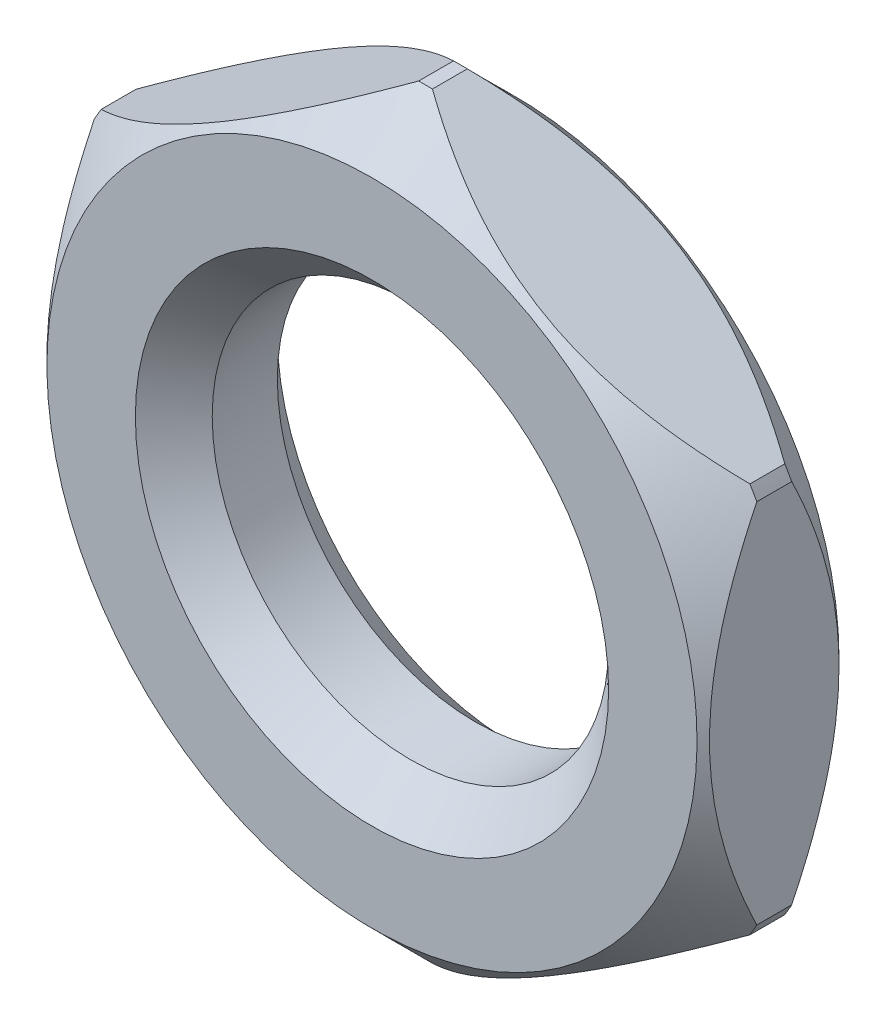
ISO-10303-21;
HEADER;
FILE_DESCRIPTION(('STEP AP214'),'2;1');
FILE_NAME('part.step','',(''),(''),'','','');
FILE_SCHEMA(('AUTOMOTIVE_DESIGN { 1 0 10303 214 1 1 1 1 }'));
ENDSEC;
DATA;
#1=APPLICATION_CONTEXT('core data for automotive mechanical design processes');
#2=APPLICATION_PROTOCOL_DEFINITION('international standard','automotive_design',2000,#1);
#3=PRODUCT_CONTEXT('',#1,'mechanical');
#4=PRODUCT('Part','Part','',(#3));
#5=PRODUCT_RELATED_PRODUCT_CATEGORY('part','',(#4));
#6=PRODUCT_DEFINITION_FORMATION('','',#4);
#7=PRODUCT_DEFINITION_CONTEXT('part definition',#1,'design');
#8=PRODUCT_DEFINITION('design','',#6,#7);
#9=PRODUCT_DEFINITION_SHAPE('','',#8);
#10=(LENGTH_UNIT() NAMED_UNIT(*) SI_UNIT(.MILLI.,.METRE.));
#11=(NAMED_UNIT(*) PLANE_ANGLE_UNIT() SI_UNIT($,.RADIAN.));
#12=(NAMED_UNIT(*) SI_UNIT($,.STERADIAN.) SOLID_ANGLE_UNIT());
#13=UNCERTAINTY_MEASURE_WITH_UNIT(LENGTH_MEASURE(1.E-05),#10,'distance_accuracy_value','');
#14=(GEOMETRIC_REPRESENTATION_CONTEXT(3) GLOBAL_UNCERTAINTY_ASSIGNED_CONTEXT((#13)) GLOBAL_UNIT_ASSIGNED_CONTEXT((#10,
#11,#12)) REPRESENTATION_CONTEXT('',''));
#15=CARTESIAN_POINT('',(0.,0.,0.));
#16=DIRECTION('',(0.,0.,1.));
#17=DIRECTION('',(1.,0.,0.));
#18=AXIS2_PLACEMENT_3D('',#15,#16,#17);
#19=CARTESIAN_POINT('',(0.,5.,0.));
#20=DIRECTION('',(0.,0.,-1.));
#21=DIRECTION('',(-1.,0.,0.));
#22=AXIS2_PLACEMENT_3D('',#19,#20,#21);
#23=PLANE('',#22);
#24=CARTESIAN_POINT('',(0.,0.,0.));
#25=DIRECTION('',(0.,0.,-1.));
#26=DIRECTION('',(-1.,0.,0.));
#27=AXIS2_PLACEMENT_3D('',#24,#25,#26);
#28=CIRCLE('',#27,4.99999999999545);
#29=CARTESIAN_POINT('',(-4.99999999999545,0.,0.));
#30=VERTEX_POINT('',#29);
#31=EDGE_CURVE('E19',#30,#30,#28,.F.);
#32=ORIENTED_EDGE('',*,*,#31,.T.);
#33=EDGE_LOOP('',(#32));
#34=FACE_BOUND('',#33,.T.);
#35=CARTESIAN_POINT('',(0.,0.,0.));
#36=DIRECTION('',(0.,0.,1.));
#37=DIRECTION('',(1.,0.,0.));
#38=AXIS2_PLACEMENT_3D('',#35,#36,#37);
#39=CIRCLE('',#38,6.86862915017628);
#40=CARTESIAN_POINT('',(6.86862915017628,0.,0.));
#41=VERTEX_POINT('',#40);
#42=EDGE_CURVE('E135',#41,#41,#39,.T.);
#43=ORIENTED_EDGE('',*,*,#42,.F.);
#44=EDGE_LOOP('',(#43));
#45=FACE_BOUND('',#44,.T.);
#46=ADVANCED_FACE('F16',(#34,#45),#23,.T.);
#47=CARTESIAN_POINT('',(0.,0.,0.));
#48=DIRECTION('',(0.,0.,-1.));
#49=DIRECTION('',(-1.,0.,0.));
#50=AXIS2_PLACEMENT_3D('',#47,#48,#49);
#51=CONICAL_SURFACE('',#50,4.99999999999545,0.785398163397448);
#52=CARTESIAN_POINT('',(0.,0.,0.812));
#53=DIRECTION('',(0.,0.,1.));
#54=DIRECTION('',(1.,0.,0.));
#55=AXIS2_PLACEMENT_3D('',#52,#53,#54);
#56=CIRCLE('',#55,4.188);
#57=CARTESIAN_POINT('',(4.188,0.,0.812));
#58=VERTEX_POINT('',#57);
#59=EDGE_CURVE('E112',#58,#58,#56,.T.);
#60=ORIENTED_EDGE('',*,*,#59,.T.);
#61=EDGE_LOOP('',(#60));
#62=FACE_BOUND('',#61,.T.);
#63=ORIENTED_EDGE('',*,*,#31,.F.);
#64=EDGE_LOOP('',(#63));
#65=FACE_BOUND('',#64,.T.);
#66=ADVANCED_FACE('F250',(#62,#65),#51,.F.);
#67=CARTESIAN_POINT('',(0.,0.,1.13137084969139));
#68=DIRECTION('',(0.,0.,1.));
#69=DIRECTION('',(1.,0.,0.));
#70=AXIS2_PLACEMENT_3D('',#67,#68,#69);
#71=CONICAL_SURFACE('',#70,7.99999999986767,0.785398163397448);
#72=ORIENTED_EDGE('',*,*,#42,.T.);
#73=EDGE_LOOP('',(#72));
#74=FACE_BOUND('',#73,.T.);
#75=CARTESIAN_POINT('',(-6.99999999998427,-3.87298334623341,1.13137084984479));
#76=CARTESIAN_POINT('',(-6.9999999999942,-3.73890234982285,1.06646789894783));
#77=CARTESIAN_POINT('',(-6.99999999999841,-3.60381503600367,1.00364050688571));
#78=CARTESIAN_POINT('',(-7.00000000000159,-3.33145367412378,0.882735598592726));
#79=CARTESIAN_POINT('',(-7.00000000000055,-3.19417855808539,0.824660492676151));
#80=CARTESIAN_POINT('',(-6.99999999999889,-2.77770104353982,0.65803272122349));
#81=CARTESIAN_POINT('',(-6.99999999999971,-2.49511749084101,0.557706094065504));
#82=CARTESIAN_POINT('',(-7.00000000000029,-1.92540167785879,0.386349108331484));
#83=CARTESIAN_POINT('',(-7.00000000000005,-1.63839364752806,0.314917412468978));
#84=CARTESIAN_POINT('',(-6.99999999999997,-1.20352314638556,0.232651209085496));
#85=CARTESIAN_POINT('',(-6.99999999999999,-1.05796660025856,0.209385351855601));
#86=CARTESIAN_POINT('',(-7.00000000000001,-0.76572878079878,0.171637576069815));
#87=CARTESIAN_POINT('',(-7.,-0.61904764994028,0.157154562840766));
#88=CARTESIAN_POINT('',(-7.,-0.253257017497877,0.132555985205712));
#89=CARTESIAN_POINT('',(-7.,-0.0337446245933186,0.128023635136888));
#90=CARTESIAN_POINT('',(-7.,0.404777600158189,0.139633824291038));
#91=CARTESIAN_POINT('',(-7.,0.62378723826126,0.155783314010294));
#92=CARTESIAN_POINT('',(-7.,1.05962444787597,0.207804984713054));
#93=CARTESIAN_POINT('',(-7.,1.27644975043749,0.2436958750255));
#94=CARTESIAN_POINT('',(-7.,1.70632611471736,0.333267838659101));
#95=CARTESIAN_POINT('',(-7.,1.91937750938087,0.386947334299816));
#96=CARTESIAN_POINT('',(-7.,2.28037530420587,0.492038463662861));
#97=CARTESIAN_POINT('',(-7.,2.42944494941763,0.539672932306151));
#98=CARTESIAN_POINT('',(-7.,2.72518033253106,0.641854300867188));
#99=CARTESIAN_POINT('',(-7.,2.87184624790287,0.696400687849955));
#100=CARTESIAN_POINT('',(-7.,3.16229217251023,0.811367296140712));
#101=CARTESIAN_POINT('',(-7.,3.30607997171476,0.871767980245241));
#102=CARTESIAN_POINT('',(-7.,3.59128027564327,0.997817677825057));
#103=CARTESIAN_POINT('',(-7.,3.73269360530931,1.06346482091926));
#104=CARTESIAN_POINT('',(-7.,3.87298334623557,1.13137084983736));
#105=B_SPLINE_CURVE_WITH_KNOTS('',3,(#75,#76,#77,#78,#79,#80,#81,#82,#83,#84,#85,#86,#87,#88,
#89,#90,#91,#92,#93,#94,#95,#96,#97,#98,#99,#100,#101,#102,#103,#104),.UNSPECIFIED.,.F.,.F.,(4,
2,2,2,2,2,2,2,2,2,2,2,2,2,4),(0.,0.446863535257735,0.893952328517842,1.79237297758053,
2.67784702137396,3.11982657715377,3.56175103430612,4.21940284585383,4.87727573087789,
5.53577317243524,6.19421222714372,6.66352905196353,7.13281106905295,7.60057763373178,
8.06817817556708),.UNSPECIFIED.);
#106=CARTESIAN_POINT('',(-7.,-3.87298334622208,1.1313708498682));
#107=VERTEX_POINT('',#106);
#108=CARTESIAN_POINT('',(-7.,3.87298334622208,1.1313708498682));
#109=VERTEX_POINT('',#108);
#110=EDGE_CURVE('E118',#107,#109,#105,.T.);
#111=ORIENTED_EDGE('',*,*,#110,.T.);
#112=CARTESIAN_POINT('',(0.,0.,1.13137084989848));
#113=DIRECTION('',(0.,0.,1.));
#114=DIRECTION('',(1.,0.,0.));
#115=AXIS2_PLACEMENT_3D('',#112,#113,#114);
#116=CIRCLE('',#115,8.);
#117=CARTESIAN_POINT('',(-6.85410196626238,4.12568615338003,1.1313708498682));
#118=VERTEX_POINT('',#117);
#119=EDGE_CURVE('E115',#118,#109,#116,.T.);
#120=ORIENTED_EDGE('',*,*,#119,.F.);
#121=CARTESIAN_POINT('',(-6.85410196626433,4.12568615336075,1.13137084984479));
#122=CARTESIAN_POINT('',(-6.73798441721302,4.19272665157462,1.06646789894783));
#123=CARTESIAN_POINT('',(-6.62099537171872,4.26027030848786,1.00364050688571));
#124=CARTESIAN_POINT('',(-6.385123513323,4.39645098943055,0.882735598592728));
#125=CARTESIAN_POINT('',(-6.26623977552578,4.46508854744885,0.824660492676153));
#126=CARTESIAN_POINT('',(-5.90555966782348,4.67332730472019,0.658032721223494));
#127=CARTESIAN_POINT('',(-5.66083513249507,4.8146190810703,0.557706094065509));
#128=CARTESIAN_POINT('',(-5.16744676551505,5.09947698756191,0.386349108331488));
#129=CARTESIAN_POINT('',(-4.91889052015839,5.24298100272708,0.31491741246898));
#130=CARTESIAN_POINT('',(-4.54228161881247,5.46041625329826,0.232651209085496));
#131=CARTESIAN_POINT('',(-4.41622595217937,5.53319452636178,0.2093853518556));
#132=CARTESIAN_POINT('',(-4.16314057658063,5.67931343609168,0.171637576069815));
#133=CARTESIAN_POINT('',(-4.03611099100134,5.75265400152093,0.157154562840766));
#134=CARTESIAN_POINT('',(-3.71932701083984,5.93554931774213,0.132555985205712));
#135=CARTESIAN_POINT('',(-3.52922370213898,6.04530551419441,0.128023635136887));
#136=CARTESIAN_POINT('',(-3.1494523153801,6.26456662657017,0.139633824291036));
#137=CARTESIAN_POINT('',(-2.9597844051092,6.3740714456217,0.155783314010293));
#138=CARTESIAN_POINT('',(-2.58233830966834,6.59199005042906,0.207804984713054));
#139=CARTESIAN_POINT('',(-2.39456208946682,6.70040270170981,0.2436958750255));
#140=CARTESIAN_POINT('',(-2.02227823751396,6.91534088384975,0.333267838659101));
#141=CARTESIAN_POINT('',(-1.83777031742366,7.02186658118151,0.386947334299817));
#142=CARTESIAN_POINT('',(-1.52513705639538,7.20236547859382,0.492038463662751));
#143=CARTESIAN_POINT('',(-1.39603895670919,7.27690030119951,0.53967293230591));
#144=CARTESIAN_POINT('',(-1.13992460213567,7.42476799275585,0.641854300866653));
#145=CARTESIAN_POINT('',(-1.0129081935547,7.49810095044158,0.696400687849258));
#146=CARTESIAN_POINT('',(-0.761374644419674,7.6433239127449,0.811367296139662));
#147=CARTESIAN_POINT('',(-0.636850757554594,7.715217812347,0.871767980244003));
#148=CARTESIAN_POINT('',(-0.389860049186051,7.85781796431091,0.997817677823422));
#149=CARTESIAN_POINT('',(-0.26739251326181,7.92852462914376,1.06346482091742));
#150=CARTESIAN_POINT('',(-0.145898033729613,7.99866949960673,1.1313708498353));
#151=B_SPLINE_CURVE_WITH_KNOTS('',3,(#121,#122,#123,#124,#125,#126,#127,#128,#129,#130,#131,
#132,#133,#134,#135,#136,#137,#138,#139,#140,#141,#142,#143,#144,#145,#146,#147,#148,#149,#150),
.UNSPECIFIED.,.F.,.F.,(4,2,2,2,2,2,2,2,2,2,2,2,2,2,4),(0.,0.446863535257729,0.893952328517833,
1.79237297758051,2.67784702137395,3.11982657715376,3.56175103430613,4.21940284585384,
4.8772757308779,5.53577317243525,6.19421222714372,6.66352905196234,7.13281106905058,
7.60057763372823,8.06817817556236),.UNSPECIFIED.);
#152=CARTESIAN_POINT('',(-0.145898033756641,7.99866949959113,1.13137084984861));
#153=VERTEX_POINT('',#152);
#154=EDGE_CURVE('E103',#118,#153,#151,.T.);
#155=ORIENTED_EDGE('',*,*,#154,.T.);
#156=CARTESIAN_POINT('',(0.,0.,1.13137084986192));
#157=DIRECTION('',(0.,0.,1.));
#158=DIRECTION('',(1.,0.,0.));
#159=AXIS2_PLACEMENT_3D('',#156,#157,#158);
#160=CIRCLE('',#159,7.99999999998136);
#161=CARTESIAN_POINT('',(0.145898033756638,7.99866949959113,1.13137084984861));
#162=VERTEX_POINT('',#161);
#163=EDGE_CURVE('E138',#153,#162,#160,.F.);
#164=ORIENTED_EDGE('',*,*,#163,.T.);
#165=CARTESIAN_POINT('',(0.145898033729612,7.99866949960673,1.1313708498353));
#166=CARTESIAN_POINT('',(0.262015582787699,7.9316290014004,1.06646789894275));
#167=CARTESIAN_POINT('',(0.379004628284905,7.86408534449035,1.00364050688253));
#168=CARTESIAN_POINT('',(0.61487648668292,7.72790466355,0.882735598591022));
#169=CARTESIAN_POINT('',(0.733760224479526,7.65926710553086,0.824660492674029));
#170=CARTESIAN_POINT('',(1.09444033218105,7.45102834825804,0.658032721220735));
#171=CARTESIAN_POINT('',(1.3391648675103,7.3097365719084,0.557706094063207));
#172=CARTESIAN_POINT('',(1.83255323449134,7.02487866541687,0.386349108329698));
#173=CARTESIAN_POINT('',(2.0811094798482,6.88137465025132,0.314917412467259));
#174=CARTESIAN_POINT('',(2.45771838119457,6.66393939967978,0.232651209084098));
#175=CARTESIAN_POINT('',(2.58377404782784,6.59116112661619,0.209385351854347));
#176=CARTESIAN_POINT('',(2.83685942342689,6.44504221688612,0.171637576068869));
#177=CARTESIAN_POINT('',(2.96388900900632,6.37170165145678,0.157154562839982));
#178=CARTESIAN_POINT('',(3.28067298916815,6.18880633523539,0.132555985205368));
#179=CARTESIAN_POINT('',(3.47077629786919,6.07905013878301,0.128023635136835));
#180=CARTESIAN_POINT('',(3.85054768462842,5.85978902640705,0.139633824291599));
#181=CARTESIAN_POINT('',(4.04021559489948,5.75028420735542,0.155783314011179));
#182=CARTESIAN_POINT('',(4.41766169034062,5.5323656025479,0.207804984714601));
#183=CARTESIAN_POINT('',(4.60543791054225,5.42395295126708,0.24369587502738));
#184=CARTESIAN_POINT('',(4.97772176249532,5.20901476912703,0.333267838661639));
#185=CARTESIAN_POINT('',(5.16222968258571,5.10248907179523,0.386947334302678));
#186=CARTESIAN_POINT('',(5.47486294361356,4.92199017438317,0.492038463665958));
#187=CARTESIAN_POINT('',(5.60396104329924,4.84745535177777,0.53967293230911));
#188=CARTESIAN_POINT('',(5.86007539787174,4.699587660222,0.641854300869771));
#189=CARTESIAN_POINT('',(5.98709180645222,4.62625470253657,0.6964006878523));
#190=CARTESIAN_POINT('',(6.23862535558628,4.4810317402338,0.811367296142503));
#191=CARTESIAN_POINT('',(6.36314924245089,4.40913784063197,0.871767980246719));
#192=CARTESIAN_POINT('',(6.61013995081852,4.26653768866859,0.997817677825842));
#193=CARTESIAN_POINT('',(6.73260748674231,4.195831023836,1.06346482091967));
#194=CARTESIAN_POINT('',(6.85410196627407,4.12568615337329,1.13137084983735));
#195=B_SPLINE_CURVE_WITH_KNOTS('',3,(#165,#166,#167,#168,#169,#170,#171,#172,#173,#174,#175,
#176,#177,#178,#179,#180,#181,#182,#183,#184,#185,#186,#187,#188,#189,#190,#191,#192,#193,#194),
.UNSPECIFIED.,.F.,.F.,(4,2,2,2,2,2,2,2,2,2,2,2,2,2,4),(0.,0.446863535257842,0.89395232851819,
1.79237297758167,2.67784702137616,3.11982657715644,3.56175103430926,4.21940284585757,
4.87727573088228,5.53577317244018,6.19421222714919,6.66352905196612,7.13281106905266,
7.60057763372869,8.06817817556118),.UNSPECIFIED.);
#196=CARTESIAN_POINT('',(6.85410196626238,4.12568615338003,1.1313708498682));
#197=VERTEX_POINT('',#196);
#198=EDGE_CURVE('E132',#162,#197,#195,.T.);
#199=ORIENTED_EDGE('',*,*,#198,.T.);
#200=CARTESIAN_POINT('',(0.,0.,1.13137084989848));
#201=DIRECTION('',(0.,0.,1.));
#202=DIRECTION('',(1.,0.,0.));
#203=AXIS2_PLACEMENT_3D('',#200,#201,#202);
#204=CIRCLE('',#203,8.);
#205=CARTESIAN_POINT('',(7.,3.87298334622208,1.1313708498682));
#206=VERTEX_POINT('',#205);
#207=EDGE_CURVE('E140',#206,#197,#204,.T.);
#208=ORIENTED_EDGE('',*,*,#207,.F.);
#209=CARTESIAN_POINT('',(6.99999999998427,3.87298334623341,1.13137084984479));
#210=CARTESIAN_POINT('',(6.9999999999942,3.73890234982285,1.06646789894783));
#211=CARTESIAN_POINT('',(6.99999999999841,3.60381503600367,1.00364050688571));
#212=CARTESIAN_POINT('',(7.00000000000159,3.33145367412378,0.882735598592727));
#213=CARTESIAN_POINT('',(7.00000000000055,3.19417855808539,0.824660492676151));
#214=CARTESIAN_POINT('',(6.99999999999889,2.77770104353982,0.65803272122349));
#215=CARTESIAN_POINT('',(6.99999999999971,2.49511749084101,0.557706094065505));
#216=CARTESIAN_POINT('',(7.00000000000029,1.92540167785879,0.386349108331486));
#217=CARTESIAN_POINT('',(7.00000000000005,1.63839364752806,0.31491741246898));
#218=CARTESIAN_POINT('',(6.99999999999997,1.20352314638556,0.232651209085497));
#219=CARTESIAN_POINT('',(6.99999999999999,1.05796660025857,0.209385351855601));
#220=CARTESIAN_POINT('',(7.00000000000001,0.765728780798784,0.171637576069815));
#221=CARTESIAN_POINT('',(7.,0.619047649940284,0.157154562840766));
#222=CARTESIAN_POINT('',(7.,0.253257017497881,0.132555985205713));
#223=CARTESIAN_POINT('',(7.,0.0337446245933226,0.128023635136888));
#224=CARTESIAN_POINT('',(7.,-0.404777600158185,0.139633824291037));
#225=CARTESIAN_POINT('',(7.,-0.623787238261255,0.155783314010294));
#226=CARTESIAN_POINT('',(7.,-1.05962444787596,0.207804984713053));
#227=CARTESIAN_POINT('',(7.,-1.27644975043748,0.243695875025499));
#228=CARTESIAN_POINT('',(7.,-1.70632611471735,0.3332678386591));
#229=CARTESIAN_POINT('',(7.,-1.91937750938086,0.386947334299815));
#230=CARTESIAN_POINT('',(7.,-2.28037530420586,0.49203846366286));
#231=CARTESIAN_POINT('',(7.,-2.42944494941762,0.539672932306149));
#232=CARTESIAN_POINT('',(7.,-2.72518033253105,0.641854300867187));
#233=CARTESIAN_POINT('',(7.,-2.87184624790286,0.696400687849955));
#234=CARTESIAN_POINT('',(7.,-3.16229217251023,0.811367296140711));
#235=CARTESIAN_POINT('',(7.,-3.30607997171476,0.87176798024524));
#236=CARTESIAN_POINT('',(7.,-3.59128027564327,0.997817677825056));
#237=CARTESIAN_POINT('',(7.,-3.73269360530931,1.06346482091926));
#238=CARTESIAN_POINT('',(7.,-3.87298334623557,1.13137084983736));
#239=B_SPLINE_CURVE_WITH_KNOTS('',3,(#209,#210,#211,#212,#213,#214,#215,#216,#217,#218,#219,
#220,#221,#222,#223,#224,#225,#226,#227,#228,#229,#230,#231,#232,#233,#234,#235,#236,#237,#238),
.UNSPECIFIED.,.F.,.F.,(4,2,2,2,2,2,2,2,2,2,2,2,2,2,4),(0.,0.446863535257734,0.893952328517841,
1.79237297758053,2.67784702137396,3.11982657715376,3.56175103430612,4.21940284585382,
4.87727573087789,5.53577317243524,6.19421222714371,6.66352905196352,7.13281106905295,
7.60057763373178,8.06817817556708),.UNSPECIFIED.);
#240=CARTESIAN_POINT('',(7.,-3.87298334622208,1.1313708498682));
#241=VERTEX_POINT('',#240);
#242=EDGE_CURVE('E267',#206,#241,#239,.T.);
#243=ORIENTED_EDGE('',*,*,#242,.T.);
#244=CARTESIAN_POINT('',(0.,0.,1.13137084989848));
#245=DIRECTION('',(0.,0.,1.));
#246=DIRECTION('',(1.,0.,0.));
#247=AXIS2_PLACEMENT_3D('',#244,#245,#246);
#248=CIRCLE('',#247,8.);
#249=CARTESIAN_POINT('',(6.85410196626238,-4.12568615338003,1.1313708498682));
#250=VERTEX_POINT('',#249);
#251=EDGE_CURVE('E144',#250,#241,#248,.T.);
#252=ORIENTED_EDGE('',*,*,#251,.F.);
#253=CARTESIAN_POINT('',(6.85410196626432,-4.12568615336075,1.13137084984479));
#254=CARTESIAN_POINT('',(6.73798441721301,-4.19272665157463,1.06646789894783));
#255=CARTESIAN_POINT('',(6.62099537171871,-4.26027030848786,1.00364050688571));
#256=CARTESIAN_POINT('',(6.38512351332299,-4.39645098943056,0.882735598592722));
#257=CARTESIAN_POINT('',(6.26623977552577,-4.46508854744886,0.824660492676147));
#258=CARTESIAN_POINT('',(5.90555966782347,-4.6733273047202,0.658032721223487));
#259=CARTESIAN_POINT('',(5.66083513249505,-4.81461908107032,0.557706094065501));
#260=CARTESIAN_POINT('',(5.16744676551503,-5.09947698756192,0.386349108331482));
#261=CARTESIAN_POINT('',(4.91889052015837,-5.24298100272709,0.314917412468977));
#262=CARTESIAN_POINT('',(4.54228161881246,-5.46041625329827,0.232651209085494));
#263=CARTESIAN_POINT('',(4.41622595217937,-5.53319452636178,0.209385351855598));
#264=CARTESIAN_POINT('',(4.16314057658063,-5.67931343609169,0.171637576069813));
#265=CARTESIAN_POINT('',(4.03611099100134,-5.75265400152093,0.157154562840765));
#266=CARTESIAN_POINT('',(3.71932701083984,-5.93554931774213,0.132555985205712));
#267=CARTESIAN_POINT('',(3.52922370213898,-6.04530551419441,0.128023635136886));
#268=CARTESIAN_POINT('',(3.14945231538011,-6.26456662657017,0.139633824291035));
#269=CARTESIAN_POINT('',(2.95978440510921,-6.3740714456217,0.155783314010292));
#270=CARTESIAN_POINT('',(2.58233830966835,-6.59199005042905,0.207804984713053));
#271=CARTESIAN_POINT('',(2.39456208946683,-6.70040270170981,0.243695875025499));
#272=CARTESIAN_POINT('',(2.02227823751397,-6.91534088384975,0.333267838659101));
#273=CARTESIAN_POINT('',(1.83777031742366,-7.02186658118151,0.386947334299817));
#274=CARTESIAN_POINT('',(1.52513705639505,-7.20236547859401,0.492038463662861));
#275=CARTESIAN_POINT('',(1.39603895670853,-7.27690030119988,0.53967293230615));
#276=CARTESIAN_POINT('',(1.13992460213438,-7.4247679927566,0.641854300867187));
#277=CARTESIAN_POINT('',(1.01290819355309,-7.4981009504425,0.696400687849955));
#278=CARTESIAN_POINT('',(0.761374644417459,-7.64332391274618,0.81136729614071));
#279=CARTESIAN_POINT('',(0.636850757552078,-7.71521781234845,0.871767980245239));
#280=CARTESIAN_POINT('',(0.389860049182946,-7.8578179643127,0.997817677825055));
#281=CARTESIAN_POINT('',(0.267392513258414,-7.92852462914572,1.06346482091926));
#282=CARTESIAN_POINT('',(0.145898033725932,-7.99866949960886,1.13137084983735));
#283=B_SPLINE_CURVE_WITH_KNOTS('',3,(#253,#254,#255,#256,#257,#258,#259,#260,#261,#262,#263,
#264,#265,#266,#267,#268,#269,#270,#271,#272,#273,#274,#275,#276,#277,#278,#279,#280,#281,#282),
.UNSPECIFIED.,.F.,.F.,(4,2,2,2,2,2,2,2,2,2,2,2,2,2,4),(0.,0.446863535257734,0.89395232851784,
1.79237297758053,2.67784702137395,3.11982657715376,3.56175103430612,4.21940284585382,
4.87727573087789,5.53577317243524,6.19421222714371,6.66352905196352,7.13281106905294,
7.60057763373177,8.06817817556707),.UNSPECIFIED.);
#284=CARTESIAN_POINT('',(0.14589803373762,-7.99866949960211,1.1313708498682));
#285=VERTEX_POINT('',#284);
#286=EDGE_CURVE('E236',#250,#285,#283,.T.);
#287=ORIENTED_EDGE('',*,*,#286,.T.);
#288=CARTESIAN_POINT('',(0.,0.,1.13137084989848));
#289=DIRECTION('',(0.,0.,1.));
#290=DIRECTION('',(1.,0.,0.));
#291=AXIS2_PLACEMENT_3D('',#288,#289,#290);
#292=CIRCLE('',#291,8.);
#293=CARTESIAN_POINT('',(-0.145898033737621,-7.99866949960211,1.1313708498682));
#294=VERTEX_POINT('',#293);
#295=EDGE_CURVE('E148',#294,#285,#292,.T.);
#296=ORIENTED_EDGE('',*,*,#295,.F.);
#297=CARTESIAN_POINT('',(-0.145898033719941,-7.99866949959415,1.13137084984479));
#298=CARTESIAN_POINT('',(-0.262015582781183,-7.93162900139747,1.06646789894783));
#299=CARTESIAN_POINT('',(-0.379004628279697,-7.86408534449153,1.00364050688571));
#300=CARTESIAN_POINT('',(-0.614876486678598,-7.72790466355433,0.882735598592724));
#301=CARTESIAN_POINT('',(-0.733760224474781,-7.65926710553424,0.824660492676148));
#302=CARTESIAN_POINT('',(-1.09444033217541,-7.45102834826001,0.658032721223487));
#303=CARTESIAN_POINT('',(-1.33916486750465,-7.30973657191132,0.557706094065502));
#304=CARTESIAN_POINT('',(-1.83255323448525,-7.02487866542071,0.386349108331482));
#305=CARTESIAN_POINT('',(-2.08110947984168,-6.88137465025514,0.314917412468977));
#306=CARTESIAN_POINT('',(-2.45771838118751,-6.66393939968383,0.232651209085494));
#307=CARTESIAN_POINT('',(-2.58377404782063,-6.59116112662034,0.209385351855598));
#308=CARTESIAN_POINT('',(-2.83685942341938,-6.44504221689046,0.171637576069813));
#309=CARTESIAN_POINT('',(-2.96388900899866,-6.37170165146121,0.157154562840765));
#310=CARTESIAN_POINT('',(-3.28067298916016,-6.18880633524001,0.132555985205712));
#311=CARTESIAN_POINT('',(-3.47077629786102,-6.07905013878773,0.128023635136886));
#312=CARTESIAN_POINT('',(-3.85054768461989,-5.85978902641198,0.139633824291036));
#313=CARTESIAN_POINT('',(-4.04021559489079,-5.75028420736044,0.155783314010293));
#314=CARTESIAN_POINT('',(-4.41766169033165,-5.53236560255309,0.207804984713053));
#315=CARTESIAN_POINT('',(-4.60543791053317,-5.42395295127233,0.243695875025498));
#316=CARTESIAN_POINT('',(-4.97772176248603,-5.20901476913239,0.3332678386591));
#317=CARTESIAN_POINT('',(-5.16222968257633,-5.10248907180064,0.386947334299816));
#318=CARTESIAN_POINT('',(-5.47486294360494,-4.92199017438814,0.49203846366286));
#319=CARTESIAN_POINT('',(-5.60396104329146,-4.84745535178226,0.539672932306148));
#320=CARTESIAN_POINT('',(-5.86007539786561,-4.69958766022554,0.641854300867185));
#321=CARTESIAN_POINT('',(-5.9870918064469,-4.62625470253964,0.696400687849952));
#322=CARTESIAN_POINT('',(-6.23862535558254,-4.48103174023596,0.811367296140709));
#323=CARTESIAN_POINT('',(-6.36314924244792,-4.40913784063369,0.871767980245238));
#324=CARTESIAN_POINT('',(-6.61013995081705,-4.26653768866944,0.997817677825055));
#325=CARTESIAN_POINT('',(-6.73260748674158,-4.19583102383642,1.06346482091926));
#326=CARTESIAN_POINT('',(-6.85410196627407,-4.12568615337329,1.13137084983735));
#327=B_SPLINE_CURVE_WITH_KNOTS('',3,(#297,#298,#299,#300,#301,#302,#303,#304,#305,#306,#307,
#308,#309,#310,#311,#312,#313,#314,#315,#316,#317,#318,#319,#320,#321,#322,#323,#324,#325,#326),
.UNSPECIFIED.,.F.,.F.,(4,2,2,2,2,2,2,2,2,2,2,2,2,2,4),(0.,0.446863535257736,0.893952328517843,
1.79237297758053,2.67784702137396,3.11982657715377,3.56175103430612,4.21940284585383,
4.87727573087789,5.53577317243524,6.19421222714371,6.66352905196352,7.13281106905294,
7.60057763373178,8.06817817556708),.UNSPECIFIED.);
#328=CARTESIAN_POINT('',(-6.85410196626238,-4.12568615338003,1.1313708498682));
#329=VERTEX_POINT('',#328);
#330=EDGE_CURVE('E227',#294,#329,#327,.T.);
#331=ORIENTED_EDGE('',*,*,#330,.T.);
#332=CARTESIAN_POINT('',(0.,0.,1.13137084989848));
#333=DIRECTION('',(0.,0.,1.));
#334=DIRECTION('',(1.,0.,0.));
#335=AXIS2_PLACEMENT_3D('',#332,#333,#334);
#336=CIRCLE('',#335,8.);
#337=EDGE_CURVE('E152',#107,#329,#336,.T.);
#338=ORIENTED_EDGE('',*,*,#337,.F.);
#339=EDGE_LOOP('',(#111,#120,#155,#164,#199,#208,#243,#252,#287,#296,#331,#338));
#340=FACE_BOUND('',#339,.T.);
#341=ADVANCED_FACE('F116',(#74,#340),#71,.T.);
#342=CARTESIAN_POINT('',(0.,0.,-50.));
#343=DIRECTION('',(0.,0.,1.));
#344=DIRECTION('',(1.,0.,0.));
#345=AXIS2_PLACEMENT_3D('',#342,#343,#344);
#346=CYLINDRICAL_SURFACE('',#345,4.188);
#347=CARTESIAN_POINT('',(0.,0.,2.1879999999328));
#348=DIRECTION('',(0.,0.,1.));
#349=DIRECTION('',(1.,0.,0.));
#350=AXIS2_PLACEMENT_3D('',#347,#348,#349);
#351=CIRCLE('',#350,4.1879999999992);
#352=CARTESIAN_POINT('',(4.1879999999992,0.,2.1879999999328));
#353=VERTEX_POINT('',#352);
#354=EDGE_CURVE('E308',#353,#353,#351,.T.);
#355=ORIENTED_EDGE('',*,*,#354,.T.);
#356=EDGE_LOOP('',(#355));
#357=FACE_BOUND('',#356,.T.);
#358=ORIENTED_EDGE('',*,*,#59,.F.);
#359=EDGE_LOOP('',(#358));
#360=FACE_BOUND('',#359,.T.);
#361=ADVANCED_FACE('F249',(#357,#360),#346,.F.);
#362=CARTESIAN_POINT('',(0.,8.08290376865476,15.));
#363=DIRECTION('',(0.5,-0.866025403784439,0.));
#364=DIRECTION('',(0.866025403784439,0.5,0.));
#365=AXIS2_PLACEMENT_3D('',#362,#363,#364);
#366=PLANE('',#365);
#367=DIRECTION('',(0.,0.,1.));
#368=VECTOR('',#367,1.);
#369=CARTESIAN_POINT('',(-6.85410196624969,4.12568615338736,-50.));
#370=LINE('',#369,#368);
#371=CARTESIAN_POINT('',(-6.85410196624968,4.12568615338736,1.86862915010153));
#372=VERTEX_POINT('',#371);
#373=EDGE_CURVE('E107',#372,#118,#370,.F.);
#374=ORIENTED_EDGE('',*,*,#373,.F.);
#375=CARTESIAN_POINT('',(-0.145898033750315,7.99866949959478,1.86862915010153));
#376=CARTESIAN_POINT('',(-0.262015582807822,7.93162900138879,1.93353210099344));
#377=CARTESIAN_POINT('',(-0.37900462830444,7.86408534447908,1.99635949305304));
#378=CARTESIAN_POINT('',(-0.614876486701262,7.72790466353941,2.11726440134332));
#379=CARTESIAN_POINT('',(-0.733760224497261,7.65926710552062,2.17533950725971));
#380=CARTESIAN_POINT('',(-1.09444033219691,7.45102834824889,2.34196727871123));
#381=CARTESIAN_POINT('',(-1.33916486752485,7.3097365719,2.44229390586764));
#382=CARTESIAN_POINT('',(-1.83255323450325,7.02487866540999,2.61365089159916));
#383=CARTESIAN_POINT('',(-2.08110947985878,6.88137465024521,2.68508258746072));
#384=CARTESIAN_POINT('',(-2.45771838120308,6.66393939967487,2.7673487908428));
#385=CARTESIAN_POINT('',(-2.58377404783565,6.59116112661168,2.79061464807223));
#386=CARTESIAN_POINT('',(-2.83685942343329,6.44504221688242,2.82836242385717));
#387=CARTESIAN_POINT('',(-2.96388900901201,6.37170165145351,2.84284543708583));
#388=CARTESIAN_POINT('',(-3.2806729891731,6.18880633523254,2.86744401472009));
#389=CARTESIAN_POINT('',(-3.4707762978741,6.07905013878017,2.87197636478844));
#390=CARTESIAN_POINT('',(-3.85054768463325,5.85978902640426,2.86036617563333));
#391=CARTESIAN_POINT('',(-4.04021559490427,5.75028420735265,2.84421668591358));
#392=CARTESIAN_POINT('',(-4.41766169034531,5.5323656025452,2.79219501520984));
#393=CARTESIAN_POINT('',(-4.60543791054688,5.42395295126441,2.75630412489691));
#394=CARTESIAN_POINT('',(-4.97772176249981,5.20901476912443,2.66673216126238));
#395=CARTESIAN_POINT('',(-5.16222968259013,5.10248907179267,2.61305266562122));
#396=CARTESIAN_POINT('',(-5.47486294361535,4.92199017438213,2.5079615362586));
#397=CARTESIAN_POINT('',(-5.60396104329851,4.84745535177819,2.46032706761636));
#398=CARTESIAN_POINT('',(-5.86007539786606,4.69958766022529,2.35814569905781));
#399=CARTESIAN_POINT('',(-5.9870918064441,4.62625470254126,2.30359931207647));
#400=CARTESIAN_POINT('',(-6.23862535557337,4.48103174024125,2.18863270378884));
#401=CARTESIAN_POINT('',(-6.36314924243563,4.40913784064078,2.12823201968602));
#402=CARTESIAN_POINT('',(-6.61013995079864,4.26653768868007,2.00218232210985));
#403=CARTESIAN_POINT('',(-6.73260748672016,4.19583102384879,1.93653517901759));
#404=CARTESIAN_POINT('',(-6.85410196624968,4.12568615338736,1.86862915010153));
#405=B_SPLINE_CURVE_WITH_KNOTS('',3,(#375,#376,#377,#378,#379,#380,#381,#382,#383,#384,#385,
#386,#387,#388,#389,#390,#391,#392,#393,#394,#395,#396,#397,#398,#399,#400,#401,#402,#403,#404),
.UNSPECIFIED.,.F.,.F.,(4,2,2,2,2,2,2,2,2,2,2,2,2,2,4),(0.,0.446863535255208,0.893952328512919,
1.79237297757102,2.67784702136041,3.11982657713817,3.56175103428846,4.21940284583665,
4.87727573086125,5.53577317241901,6.19421222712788,6.66352905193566,7.13281106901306,
7.60057763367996,8.06817817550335),.UNSPECIFIED.);
#406=CARTESIAN_POINT('',(-0.145898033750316,7.99866949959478,1.86862915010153));
#407=VERTEX_POINT('',#406);
#408=EDGE_CURVE('E310',#407,#372,#405,.T.);
#409=ORIENTED_EDGE('',*,*,#408,.F.);
#410=DIRECTION('',(0.,0.,1.));
#411=VECTOR('',#410,1.);
#412=CARTESIAN_POINT('',(-0.145898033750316,7.99866949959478,-50.));
#413=LINE('',#412,#411);
#414=EDGE_CURVE('E110',#153,#407,#413,.T.);
#415=ORIENTED_EDGE('',*,*,#414,.F.);
#416=ORIENTED_EDGE('',*,*,#154,.F.);
#417=EDGE_LOOP('',(#374,#409,#415,#416));
#418=FACE_BOUND('',#417,.T.);
#419=ADVANCED_FACE('F105',(#418),#366,.F.);
#420=CARTESIAN_POINT('',(0.,0.,-50.));
#421=DIRECTION('',(0.,0.,1.));
#422=DIRECTION('',(1.,0.,0.));
#423=AXIS2_PLACEMENT_3D('',#420,#421,#422);
#424=CYLINDRICAL_SURFACE('',#423,8.);
#425=DIRECTION('',(0.,0.,-1.));
#426=VECTOR('',#425,1.);
#427=CARTESIAN_POINT('',(-7.,3.87298334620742,15.));
#428=LINE('',#427,#426);
#429=CARTESIAN_POINT('',(-7.,3.87298334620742,1.86862915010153));
#430=VERTEX_POINT('',#429);
#431=EDGE_CURVE('E121',#109,#430,#428,.F.);
#432=ORIENTED_EDGE('',*,*,#431,.T.);
#433=CARTESIAN_POINT('',(0.,0.,1.86862915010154));
#434=DIRECTION('',(0.,0.,-1.));
#435=DIRECTION('',(-1.,0.,0.));
#436=AXIS2_PLACEMENT_3D('',#433,#434,#435);
#437=CIRCLE('',#436,8.);
#438=EDGE_CURVE('E125',#372,#430,#437,.F.);
#439=ORIENTED_EDGE('',*,*,#438,.F.);
#440=ORIENTED_EDGE('',*,*,#373,.T.);
#441=ORIENTED_EDGE('',*,*,#119,.T.);
#442=EDGE_LOOP('',(#432,#439,#440,#441));
#443=FACE_BOUND('',#442,.T.);
#444=ADVANCED_FACE('F123',(#443),#424,.T.);
#445=CARTESIAN_POINT('',(-7.,4.04145188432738,15.));
#446=DIRECTION('',(1.,0.,0.));
#447=DIRECTION('',(0.,0.,-1.));
#448=AXIS2_PLACEMENT_3D('',#445,#446,#447);
#449=PLANE('',#448);
#450=DIRECTION('',(0.,0.,1.));
#451=VECTOR('',#450,1.);
#452=CARTESIAN_POINT('',(-7.,-3.87298334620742,-50.));
#453=LINE('',#452,#451);
#454=CARTESIAN_POINT('',(-7.,-3.87298334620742,1.86862915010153));
#455=VERTEX_POINT('',#454);
#456=EDGE_CURVE('E154',#455,#107,#453,.F.);
#457=ORIENTED_EDGE('',*,*,#456,.F.);
#458=CARTESIAN_POINT('',(-7.,3.87298334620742,1.86862915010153));
#459=CARTESIAN_POINT('',(-7.,3.73890234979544,1.93353210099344));
#460=CARTESIAN_POINT('',(-7.,3.60381503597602,1.99635949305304));
#461=CARTESIAN_POINT('',(-7.,3.33145367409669,2.11726440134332));
#462=CARTESIAN_POINT('',(-7.,3.19417855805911,2.17533950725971));
#463=CARTESIAN_POINT('',(-7.,2.77770104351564,2.34196727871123));
#464=CARTESIAN_POINT('',(-7.,2.49511749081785,2.44229390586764));
#465=CARTESIAN_POINT('',(-7.,1.92540167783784,2.61365089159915));
#466=CARTESIAN_POINT('',(-7.,1.63839364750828,2.68508258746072));
#467=CARTESIAN_POINT('',(-7.,1.2035231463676,2.7673487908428));
#468=CARTESIAN_POINT('',(-7.,1.05796660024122,2.79061464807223));
#469=CARTESIAN_POINT('',(-7.,0.765728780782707,2.82836242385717));
#470=CARTESIAN_POINT('',(-7.,0.619047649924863,2.84284543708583));
#471=CARTESIAN_POINT('',(-7.,0.253257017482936,2.86744401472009));
#472=CARTESIAN_POINT('',(-7.,0.0337446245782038,2.87197636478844));
#473=CARTESIAN_POINT('',(-7.,-0.40477760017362,2.86036617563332));
#474=CARTESIAN_POINT('',(-7.,-0.623787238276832,2.84421668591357));
#475=CARTESIAN_POINT('',(-7.,-1.05962444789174,2.79219501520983));
#476=CARTESIAN_POINT('',(-7.,-1.27644975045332,2.7563041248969));
#477=CARTESIAN_POINT('',(-7.,-1.70632611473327,2.66673216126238));
#478=CARTESIAN_POINT('',(-7.,-1.9193775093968,2.61305266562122));
#479=CARTESIAN_POINT('',(-7.,-2.28037530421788,2.5079615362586));
#480=CARTESIAN_POINT('',(-7.,-2.42944494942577,2.46032706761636));
#481=CARTESIAN_POINT('',(-7.,-2.72518033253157,2.35814569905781));
#482=CARTESIAN_POINT('',(-7.,-2.87184624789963,2.30359931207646));
#483=CARTESIAN_POINT('',(-7.,-3.16229217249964,2.18863270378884));
#484=CARTESIAN_POINT('',(-7.,-3.30607997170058,2.12823201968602));
#485=CARTESIAN_POINT('',(-7.,-3.59128027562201,2.00218232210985));
#486=CARTESIAN_POINT('',(-7.,-3.73269360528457,1.93653517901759));
#487=CARTESIAN_POINT('',(-7.,-3.87298334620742,1.86862915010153));
#488=B_SPLINE_CURVE_WITH_KNOTS('',3,(#458,#459,#460,#461,#462,#463,#464,#465,#466,#467,#468,
#469,#470,#471,#472,#473,#474,#475,#476,#477,#478,#479,#480,#481,#482,#483,#484,#485,#486,#487),
.UNSPECIFIED.,.F.,.F.,(4,2,2,2,2,2,2,2,2,2,2,2,2,2,4),(0.,0.446863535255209,0.89395232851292,
1.79237297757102,2.67784702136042,3.11982657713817,3.56175103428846,4.21940284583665,
4.87727573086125,5.53577317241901,6.19421222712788,6.66352905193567,7.13281106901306,
7.60057763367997,8.06817817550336),.UNSPECIFIED.);
#489=EDGE_CURVE('E191',#430,#455,#488,.T.);
#490=ORIENTED_EDGE('',*,*,#489,.F.);
#491=ORIENTED_EDGE('',*,*,#431,.F.);
#492=ORIENTED_EDGE('',*,*,#110,.F.);
#493=EDGE_LOOP('',(#457,#490,#491,#492));
#494=FACE_BOUND('',#493,.T.);
#495=ADVANCED_FACE('F341',(#494),#449,.F.);
#496=CARTESIAN_POINT('',(0.,0.,-50.));
#497=DIRECTION('',(0.,0.,1.));
#498=DIRECTION('',(1.,0.,0.));
#499=AXIS2_PLACEMENT_3D('',#496,#497,#498);
#500=CYLINDRICAL_SURFACE('',#499,8.);
#501=ORIENTED_EDGE('',*,*,#456,.T.);
#502=ORIENTED_EDGE('',*,*,#337,.T.);
#503=DIRECTION('',(0.,0.,1.));
#504=VECTOR('',#503,1.);
#505=CARTESIAN_POINT('',(-6.85410196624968,-4.12568615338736,15.));
#506=LINE('',#505,#504);
#507=CARTESIAN_POINT('',(-6.85410196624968,-4.12568615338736,1.86862915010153));
#508=VERTEX_POINT('',#507);
#509=EDGE_CURVE('E153',#329,#508,#506,.T.);
#510=ORIENTED_EDGE('',*,*,#509,.T.);
#511=CARTESIAN_POINT('',(0.,0.,1.86862915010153));
#512=DIRECTION('',(0.,0.,-1.));
#513=DIRECTION('',(-1.,0.,0.));
#514=AXIS2_PLACEMENT_3D('',#511,#512,#513);
#515=CIRCLE('',#514,8.);
#516=EDGE_CURVE('E216',#455,#508,#515,.F.);
#517=ORIENTED_EDGE('',*,*,#516,.F.);
#518=EDGE_LOOP('',(#501,#502,#510,#517));
#519=FACE_BOUND('',#518,.T.);
#520=ADVANCED_FACE('F223',(#519),#500,.T.);
#521=CARTESIAN_POINT('',(-7.,-4.04145188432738,15.));
#522=DIRECTION('',(0.5,0.866025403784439,0.));
#523=DIRECTION('',(-0.866025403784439,0.5,0.));
#524=AXIS2_PLACEMENT_3D('',#521,#522,#523);
#525=PLANE('',#524);
#526=DIRECTION('',(0.,0.,1.));
#527=VECTOR('',#526,1.);
#528=CARTESIAN_POINT('',(-0.145898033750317,-7.99866949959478,-50.));
#529=LINE('',#528,#527);
#530=CARTESIAN_POINT('',(-0.145898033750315,-7.99866949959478,1.86862915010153));
#531=VERTEX_POINT('',#530);
#532=EDGE_CURVE('E151',#531,#294,#529,.F.);
#533=ORIENTED_EDGE('',*,*,#532,.F.);
#534=CARTESIAN_POINT('',(-6.85410196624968,-4.12568615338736,1.86862915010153));
#535=CARTESIAN_POINT('',(-6.73798441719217,-4.19272665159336,1.93353210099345));
#536=CARTESIAN_POINT('',(-6.62099537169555,-4.26027030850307,1.99635949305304));
#537=CARTESIAN_POINT('',(-6.38512351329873,-4.39645098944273,2.11726440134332));
#538=CARTESIAN_POINT('',(-6.26623977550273,-4.46508854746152,2.17533950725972));
#539=CARTESIAN_POINT('',(-5.90555966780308,-4.67332730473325,2.34196727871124));
#540=CARTESIAN_POINT('',(-5.66083513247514,-4.81461908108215,2.44229390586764));
#541=CARTESIAN_POINT('',(-5.16744676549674,-5.09947698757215,2.61365089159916));
#542=CARTESIAN_POINT('',(-4.91889052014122,-5.24298100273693,2.68508258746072));
#543=CARTESIAN_POINT('',(-4.54228161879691,-5.46041625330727,2.7673487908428));
#544=CARTESIAN_POINT('',(-4.41622595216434,-5.53319452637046,2.79061464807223));
#545=CARTESIAN_POINT('',(-4.1631405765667,-5.67931343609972,2.82836242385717));
#546=CARTESIAN_POINT('',(-4.03611099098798,-5.75265400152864,2.84284543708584));
#547=CARTESIAN_POINT('',(-3.7193270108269,-5.93554931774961,2.8674440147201));
#548=CARTESIAN_POINT('',(-3.52922370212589,-6.04530551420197,2.87197636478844));
#549=CARTESIAN_POINT('',(-3.14945231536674,-6.26456662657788,2.86036617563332));
#550=CARTESIAN_POINT('',(-2.95978440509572,-6.37407144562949,2.84421668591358));
#551=CARTESIAN_POINT('',(-2.58233830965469,-6.59199005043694,2.79219501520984));
#552=CARTESIAN_POINT('',(-2.39456208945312,-6.70040270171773,2.75630412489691));
#553=CARTESIAN_POINT('',(-2.02227823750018,-6.91534088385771,2.66673216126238));
#554=CARTESIAN_POINT('',(-1.83777031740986,-7.02186658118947,2.61305266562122));
#555=CARTESIAN_POINT('',(-1.52513705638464,-7.20236547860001,2.5079615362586));
#556=CARTESIAN_POINT('',(-1.39603895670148,-7.27690030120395,2.46032706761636));
#557=CARTESIAN_POINT('',(-1.13992460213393,-7.42476799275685,2.35814569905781));
#558=CARTESIAN_POINT('',(-1.0129081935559,-7.49810095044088,2.30359931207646));
#559=CARTESIAN_POINT('',(-0.761374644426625,-7.64332391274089,2.18863270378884));
#560=CARTESIAN_POINT('',(-0.63685075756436,-7.71521781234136,2.12823201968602));
#561=CARTESIAN_POINT('',(-0.389860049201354,-7.85781796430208,2.00218232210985));
#562=CARTESIAN_POINT('',(-0.267392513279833,-7.92852462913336,1.93653517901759));
#563=CARTESIAN_POINT('',(-0.145898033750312,-7.99866949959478,1.86862915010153));
#564=B_SPLINE_CURVE_WITH_KNOTS('',3,(#534,#535,#536,#537,#538,#539,#540,#541,#542,#543,#544,
#545,#546,#547,#548,#549,#550,#551,#552,#553,#554,#555,#556,#557,#558,#559,#560,#561,#562,#563),
.UNSPECIFIED.,.F.,.F.,(4,2,2,2,2,2,2,2,2,2,2,2,2,2,4),(0.,0.446863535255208,0.893952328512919,
1.79237297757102,2.67784702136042,3.11982657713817,3.56175103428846,4.21940284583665,
4.87727573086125,5.53577317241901,6.19421222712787,6.66352905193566,7.13281106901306,
7.60057763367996,8.06817817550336),.UNSPECIFIED.);
#565=EDGE_CURVE('E208',#508,#531,#564,.T.);
#566=ORIENTED_EDGE('',*,*,#565,.F.);
#567=ORIENTED_EDGE('',*,*,#509,.F.);
#568=ORIENTED_EDGE('',*,*,#330,.F.);
#569=EDGE_LOOP('',(#533,#566,#567,#568));
#570=FACE_BOUND('',#569,.T.);
#571=ADVANCED_FACE('F217',(#570),#525,.F.);
#572=CARTESIAN_POINT('',(0.,0.,-50.));
#573=DIRECTION('',(0.,0.,1.));
#574=DIRECTION('',(1.,0.,0.));
#575=AXIS2_PLACEMENT_3D('',#572,#573,#574);
#576=CYLINDRICAL_SURFACE('',#575,8.);
#577=ORIENTED_EDGE('',*,*,#532,.T.);
#578=ORIENTED_EDGE('',*,*,#295,.T.);
#579=DIRECTION('',(0.,0.,1.));
#580=VECTOR('',#579,1.);
#581=CARTESIAN_POINT('',(0.145898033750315,-7.99866949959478,15.));
#582=LINE('',#581,#580);
#583=CARTESIAN_POINT('',(0.145898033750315,-7.99866949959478,1.86862915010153));
#584=VERTEX_POINT('',#583);
#585=EDGE_CURVE('E150',#285,#584,#582,.T.);
#586=ORIENTED_EDGE('',*,*,#585,.T.);
#587=CARTESIAN_POINT('',(0.,0.,1.86862915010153));
#588=DIRECTION('',(0.,0.,-1.));
#589=DIRECTION('',(-1.,0.,0.));
#590=AXIS2_PLACEMENT_3D('',#587,#588,#589);
#591=CIRCLE('',#590,8.);
#592=EDGE_CURVE('E215',#531,#584,#591,.F.);
#593=ORIENTED_EDGE('',*,*,#592,.F.);
#594=EDGE_LOOP('',(#577,#578,#586,#593));
#595=FACE_BOUND('',#594,.T.);
#596=ADVANCED_FACE('F222',(#595),#576,.T.);
#597=CARTESIAN_POINT('',(0.,-8.08290376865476,15.));
#598=DIRECTION('',(-0.5,0.866025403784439,0.));
#599=DIRECTION('',(-0.866025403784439,-0.5,0.));
#600=AXIS2_PLACEMENT_3D('',#597,#598,#599);
#601=PLANE('',#600);
#602=DIRECTION('',(0.,0.,1.));
#603=VECTOR('',#602,1.);
#604=CARTESIAN_POINT('',(6.85410196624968,-4.12568615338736,-50.));
#605=LINE('',#604,#603);
#606=CARTESIAN_POINT('',(6.85410196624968,-4.12568615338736,1.86862915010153));
#607=VERTEX_POINT('',#606);
#608=EDGE_CURVE('E147',#607,#250,#605,.F.);
#609=ORIENTED_EDGE('',*,*,#608,.F.);
#610=CARTESIAN_POINT('',(0.145898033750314,-7.99866949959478,1.86862915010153));
#611=CARTESIAN_POINT('',(0.262015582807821,-7.93162900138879,1.93353210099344));
#612=CARTESIAN_POINT('',(0.37900462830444,-7.86408534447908,1.99635949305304));
#613=CARTESIAN_POINT('',(0.614876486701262,-7.72790466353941,2.11726440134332));
#614=CARTESIAN_POINT('',(0.733760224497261,-7.65926710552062,2.17533950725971));
#615=CARTESIAN_POINT('',(1.09444033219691,-7.45102834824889,2.34196727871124));
#616=CARTESIAN_POINT('',(1.33916486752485,-7.3097365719,2.44229390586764));
#617=CARTESIAN_POINT('',(1.83255323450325,-7.02487866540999,2.61365089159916));
#618=CARTESIAN_POINT('',(2.08110947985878,-6.88137465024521,2.68508258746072));
#619=CARTESIAN_POINT('',(2.45771838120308,-6.66393939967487,2.7673487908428));
#620=CARTESIAN_POINT('',(2.58377404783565,-6.59116112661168,2.79061464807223));
#621=CARTESIAN_POINT('',(2.83685942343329,-6.44504221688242,2.82836242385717));
#622=CARTESIAN_POINT('',(2.96388900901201,-6.37170165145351,2.84284543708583));
#623=CARTESIAN_POINT('',(3.2806729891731,-6.18880633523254,2.86744401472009));
#624=CARTESIAN_POINT('',(3.47077629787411,-6.07905013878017,2.87197636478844));
#625=CARTESIAN_POINT('',(3.85054768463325,-5.85978902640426,2.86036617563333));
#626=CARTESIAN_POINT('',(4.04021559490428,-5.75028420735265,2.84421668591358));
#627=CARTESIAN_POINT('',(4.41766169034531,-5.5323656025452,2.79219501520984));
#628=CARTESIAN_POINT('',(4.60543791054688,-5.42395295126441,2.7563041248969));
#629=CARTESIAN_POINT('',(4.97772176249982,-5.20901476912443,2.66673216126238));
#630=CARTESIAN_POINT('',(5.16222968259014,-5.10248907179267,2.61305266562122));
#631=CARTESIAN_POINT('',(5.47486294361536,-4.92199017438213,2.5079615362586));
#632=CARTESIAN_POINT('',(5.60396104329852,-4.84745535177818,2.46032706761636));
#633=CARTESIAN_POINT('',(5.86007539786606,-4.69958766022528,2.35814569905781));
#634=CARTESIAN_POINT('',(5.9870918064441,-4.62625470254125,2.30359931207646));
#635=CARTESIAN_POINT('',(6.23862535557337,-4.48103174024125,2.18863270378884));
#636=CARTESIAN_POINT('',(6.36314924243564,-4.40913784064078,2.12823201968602));
#637=CARTESIAN_POINT('',(6.61013995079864,-4.26653768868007,2.00218232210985));
#638=CARTESIAN_POINT('',(6.73260748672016,-4.19583102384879,1.93653517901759));
#639=CARTESIAN_POINT('',(6.85410196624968,-4.12568615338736,1.86862915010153));
#640=B_SPLINE_CURVE_WITH_KNOTS('',3,(#610,#611,#612,#613,#614,#615,#616,#617,#618,#619,#620,
#621,#622,#623,#624,#625,#626,#627,#628,#629,#630,#631,#632,#633,#634,#635,#636,#637,#638,#639),
.UNSPECIFIED.,.F.,.F.,(4,2,2,2,2,2,2,2,2,2,2,2,2,2,4),(0.,0.446863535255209,0.893952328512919,
1.79237297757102,2.67784702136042,3.11982657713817,3.56175103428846,4.21940284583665,
4.87727573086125,5.53577317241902,6.19421222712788,6.66352905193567,7.13281106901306,
7.60057763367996,8.06817817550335),.UNSPECIFIED.);
#641=EDGE_CURVE('E202',#584,#607,#640,.T.);
#642=ORIENTED_EDGE('',*,*,#641,.F.);
#643=ORIENTED_EDGE('',*,*,#585,.F.);
#644=ORIENTED_EDGE('',*,*,#286,.F.);
#645=EDGE_LOOP('',(#609,#642,#643,#644));
#646=FACE_BOUND('',#645,.T.);
#647=ADVANCED_FACE('F282',(#646),#601,.F.);
#648=CARTESIAN_POINT('',(0.,0.,-50.));
#649=DIRECTION('',(0.,0.,1.));
#650=DIRECTION('',(1.,0.,0.));
#651=AXIS2_PLACEMENT_3D('',#648,#649,#650);
#652=CYLINDRICAL_SURFACE('',#651,8.);
#653=ORIENTED_EDGE('',*,*,#608,.T.);
#654=ORIENTED_EDGE('',*,*,#251,.T.);
#655=DIRECTION('',(0.,0.,1.));
#656=VECTOR('',#655,1.);
#657=CARTESIAN_POINT('',(7.,-3.87298334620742,15.));
#658=LINE('',#657,#656);
#659=CARTESIAN_POINT('',(7.,-3.87298334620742,1.86862915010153));
#660=VERTEX_POINT('',#659);
#661=EDGE_CURVE('E146',#241,#660,#658,.T.);
#662=ORIENTED_EDGE('',*,*,#661,.T.);
#663=CARTESIAN_POINT('',(0.,0.,1.86862915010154));
#664=DIRECTION('',(0.,0.,-1.));
#665=DIRECTION('',(-1.,0.,0.));
#666=AXIS2_PLACEMENT_3D('',#663,#664,#665);
#667=CIRCLE('',#666,8.);
#668=EDGE_CURVE('E324',#607,#660,#667,.F.);
#669=ORIENTED_EDGE('',*,*,#668,.F.);
#670=EDGE_LOOP('',(#653,#654,#662,#669));
#671=FACE_BOUND('',#670,.T.);
#672=ADVANCED_FACE('F278',(#671),#652,.T.);
#673=CARTESIAN_POINT('',(7.,-4.04145188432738,15.));
#674=DIRECTION('',(-1.,0.,0.));
#675=DIRECTION('',(0.,0.,1.));
#676=AXIS2_PLACEMENT_3D('',#673,#674,#675);
#677=PLANE('',#676);
#678=DIRECTION('',(0.,0.,1.));
#679=VECTOR('',#678,1.);
#680=CARTESIAN_POINT('',(7.,3.87298334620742,-50.));
#681=LINE('',#680,#679);
#682=CARTESIAN_POINT('',(7.,3.87298334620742,1.86862915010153));
#683=VERTEX_POINT('',#682);
#684=EDGE_CURVE('E143',#683,#206,#681,.F.);
#685=ORIENTED_EDGE('',*,*,#684,.F.);
#686=CARTESIAN_POINT('',(7.,-3.87298334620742,1.86862915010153));
#687=CARTESIAN_POINT('',(7.,-3.73890234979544,1.93353210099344));
#688=CARTESIAN_POINT('',(7.,-3.60381503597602,1.99635949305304));
#689=CARTESIAN_POINT('',(7.,-3.33145367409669,2.11726440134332));
#690=CARTESIAN_POINT('',(7.,-3.19417855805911,2.17533950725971));
#691=CARTESIAN_POINT('',(7.,-2.77770104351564,2.34196727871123));
#692=CARTESIAN_POINT('',(7.,-2.49511749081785,2.44229390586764));
#693=CARTESIAN_POINT('',(7.,-1.92540167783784,2.61365089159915));
#694=CARTESIAN_POINT('',(7.,-1.63839364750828,2.68508258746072));
#695=CARTESIAN_POINT('',(7.,-1.2035231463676,2.7673487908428));
#696=CARTESIAN_POINT('',(7.,-1.05796660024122,2.79061464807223));
#697=CARTESIAN_POINT('',(7.,-0.765728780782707,2.82836242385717));
#698=CARTESIAN_POINT('',(7.,-0.619047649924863,2.84284543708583));
#699=CARTESIAN_POINT('',(7.,-0.253257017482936,2.86744401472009));
#700=CARTESIAN_POINT('',(7.,-0.0337446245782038,2.87197636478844));
#701=CARTESIAN_POINT('',(7.,0.40477760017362,2.86036617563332));
#702=CARTESIAN_POINT('',(7.,0.623787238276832,2.84421668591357));
#703=CARTESIAN_POINT('',(7.,1.05962444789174,2.79219501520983));
#704=CARTESIAN_POINT('',(7.,1.27644975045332,2.7563041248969));
#705=CARTESIAN_POINT('',(7.,1.70632611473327,2.66673216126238));
#706=CARTESIAN_POINT('',(7.,1.9193775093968,2.61305266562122));
#707=CARTESIAN_POINT('',(7.,2.28037530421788,2.5079615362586));
#708=CARTESIAN_POINT('',(7.,2.42944494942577,2.46032706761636));
#709=CARTESIAN_POINT('',(7.,2.72518033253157,2.35814569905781));
#710=CARTESIAN_POINT('',(7.,2.87184624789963,2.30359931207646));
#711=CARTESIAN_POINT('',(7.,3.16229217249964,2.18863270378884));
#712=CARTESIAN_POINT('',(7.,3.30607997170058,2.12823201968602));
#713=CARTESIAN_POINT('',(7.,3.59128027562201,2.00218232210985));
#714=CARTESIAN_POINT('',(7.,3.73269360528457,1.93653517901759));
#715=CARTESIAN_POINT('',(7.,3.87298334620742,1.86862915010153));
#716=B_SPLINE_CURVE_WITH_KNOTS('',3,(#686,#687,#688,#689,#690,#691,#692,#693,#694,#695,#696,
#697,#698,#699,#700,#701,#702,#703,#704,#705,#706,#707,#708,#709,#710,#711,#712,#713,#714,#715),
.UNSPECIFIED.,.F.,.F.,(4,2,2,2,2,2,2,2,2,2,2,2,2,2,4),(0.,0.446863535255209,0.89395232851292,
1.79237297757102,2.67784702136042,3.11982657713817,3.56175103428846,4.21940284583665,
4.87727573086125,5.53577317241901,6.19421222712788,6.66352905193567,7.13281106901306,
7.60057763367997,8.06817817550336),.UNSPECIFIED.);
#717=EDGE_CURVE('E169',#660,#683,#716,.T.);
#718=ORIENTED_EDGE('',*,*,#717,.F.);
#719=ORIENTED_EDGE('',*,*,#661,.F.);
#720=ORIENTED_EDGE('',*,*,#242,.F.);
#721=EDGE_LOOP('',(#685,#718,#719,#720));
#722=FACE_BOUND('',#721,.T.);
#723=ADVANCED_FACE('F273',(#722),#677,.F.);
#724=CARTESIAN_POINT('',(0.,0.,-50.));
#725=DIRECTION('',(0.,0.,1.));
#726=DIRECTION('',(1.,0.,0.));
#727=AXIS2_PLACEMENT_3D('',#724,#725,#726);
#728=CYLINDRICAL_SURFACE('',#727,8.);
#729=ORIENTED_EDGE('',*,*,#684,.T.);
#730=ORIENTED_EDGE('',*,*,#207,.T.);
#731=DIRECTION('',(0.,0.,1.));
#732=VECTOR('',#731,1.);
#733=CARTESIAN_POINT('',(6.85410196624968,4.12568615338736,15.));
#734=LINE('',#733,#732);
#735=CARTESIAN_POINT('',(6.85410196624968,4.12568615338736,1.86862915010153));
#736=VERTEX_POINT('',#735);
#737=EDGE_CURVE('E142',#197,#736,#734,.T.);
#738=ORIENTED_EDGE('',*,*,#737,.T.);
#739=CARTESIAN_POINT('',(0.,0.,1.86862915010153));
#740=DIRECTION('',(0.,0.,-1.));
#741=DIRECTION('',(-1.,0.,0.));
#742=AXIS2_PLACEMENT_3D('',#739,#740,#741);
#743=CIRCLE('',#742,8.);
#744=EDGE_CURVE('E168',#683,#736,#743,.F.);
#745=ORIENTED_EDGE('',*,*,#744,.F.);
#746=EDGE_LOOP('',(#729,#730,#738,#745));
#747=FACE_BOUND('',#746,.T.);
#748=ADVANCED_FACE('F277',(#747),#728,.T.);
#749=CARTESIAN_POINT('',(7.,4.04145188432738,15.));
#750=DIRECTION('',(-0.5,-0.866025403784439,0.));
#751=DIRECTION('',(0.866025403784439,-0.5,0.));
#752=AXIS2_PLACEMENT_3D('',#749,#750,#751);
#753=PLANE('',#752);
#754=DIRECTION('',(0.,0.,1.));
#755=VECTOR('',#754,1.);
#756=CARTESIAN_POINT('',(0.145898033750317,7.99866949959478,-50.));
#757=LINE('',#756,#755);
#758=CARTESIAN_POINT('',(0.145898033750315,7.99866949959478,1.86862915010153));
#759=VERTEX_POINT('',#758);
#760=EDGE_CURVE('E34',#759,#162,#757,.F.);
#761=ORIENTED_EDGE('',*,*,#760,.F.);
#762=CARTESIAN_POINT('',(6.85410196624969,4.12568615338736,1.86862915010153));
#763=CARTESIAN_POINT('',(6.73798441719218,4.19272665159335,1.93353210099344));
#764=CARTESIAN_POINT('',(6.62099537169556,4.26027030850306,1.99635949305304));
#765=CARTESIAN_POINT('',(6.38512351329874,4.39645098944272,2.11726440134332));
#766=CARTESIAN_POINT('',(6.26623977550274,4.46508854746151,2.17533950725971));
#767=CARTESIAN_POINT('',(5.90555966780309,4.67332730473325,2.34196727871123));
#768=CARTESIAN_POINT('',(5.66083513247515,4.81461908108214,2.44229390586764));
#769=CARTESIAN_POINT('',(5.16744676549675,5.09947698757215,2.61365089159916));
#770=CARTESIAN_POINT('',(4.91889052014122,5.24298100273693,2.68508258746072));
#771=CARTESIAN_POINT('',(4.54228161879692,5.46041625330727,2.7673487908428));
#772=CARTESIAN_POINT('',(4.41622595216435,5.53319452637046,2.79061464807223));
#773=CARTESIAN_POINT('',(4.16314057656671,5.67931343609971,2.82836242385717));
#774=CARTESIAN_POINT('',(4.03611099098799,5.75265400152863,2.84284543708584));
#775=CARTESIAN_POINT('',(3.7193270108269,5.9355493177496,2.8674440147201));
#776=CARTESIAN_POINT('',(3.52922370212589,6.04530551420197,2.87197636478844));
#777=CARTESIAN_POINT('',(3.14945231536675,6.26456662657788,2.86036617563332));
#778=CARTESIAN_POINT('',(2.95978440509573,6.37407144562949,2.84421668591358));
#779=CARTESIAN_POINT('',(2.58233830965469,6.59199005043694,2.79219501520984));
#780=CARTESIAN_POINT('',(2.39456208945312,6.70040270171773,2.75630412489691));
#781=CARTESIAN_POINT('',(2.02227823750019,6.91534088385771,2.66673216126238));
#782=CARTESIAN_POINT('',(1.83777031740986,7.02186658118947,2.61305266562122));
#783=CARTESIAN_POINT('',(1.52513705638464,7.20236547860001,2.5079615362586));
#784=CARTESIAN_POINT('',(1.39603895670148,7.27690030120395,2.46032706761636));
#785=CARTESIAN_POINT('',(1.13992460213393,7.42476799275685,2.35814569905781));
#786=CARTESIAN_POINT('',(1.0129081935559,7.49810095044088,2.30359931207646));
#787=CARTESIAN_POINT('',(0.761374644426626,7.64332391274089,2.18863270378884));
#788=CARTESIAN_POINT('',(0.636850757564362,7.71521781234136,2.12823201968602));
#789=CARTESIAN_POINT('',(0.389860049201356,7.85781796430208,2.00218232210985));
#790=CARTESIAN_POINT('',(0.267392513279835,7.92852462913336,1.93653517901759));
#791=CARTESIAN_POINT('',(0.145898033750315,7.99866949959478,1.86862915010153));
#792=B_SPLINE_CURVE_WITH_KNOTS('',3,(#762,#763,#764,#765,#766,#767,#768,#769,#770,#771,#772,
#773,#774,#775,#776,#777,#778,#779,#780,#781,#782,#783,#784,#785,#786,#787,#788,#789,#790,#791),
.UNSPECIFIED.,.F.,.F.,(4,2,2,2,2,2,2,2,2,2,2,2,2,2,4),(0.,0.446863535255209,0.89395232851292,
1.79237297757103,2.67784702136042,3.11982657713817,3.56175103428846,4.21940284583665,
4.87727573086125,5.53577317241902,6.19421222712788,6.66352905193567,7.13281106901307,
7.60057763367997,8.06817817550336),.UNSPECIFIED.);
#793=EDGE_CURVE('E159',#736,#759,#792,.T.);
#794=ORIENTED_EDGE('',*,*,#793,.F.);
#795=ORIENTED_EDGE('',*,*,#737,.F.);
#796=ORIENTED_EDGE('',*,*,#198,.F.);
#797=EDGE_LOOP('',(#761,#794,#795,#796));
#798=FACE_BOUND('',#797,.T.);
#799=ADVANCED_FACE('F176',(#798),#753,.F.);
#800=CARTESIAN_POINT('',(0.,0.,-50.));
#801=DIRECTION('',(0.,0.,1.));
#802=DIRECTION('',(1.,0.,0.));
#803=AXIS2_PLACEMENT_3D('',#800,#801,#802);
#804=CYLINDRICAL_SURFACE('',#803,8.);
#805=ORIENTED_EDGE('',*,*,#760,.T.);
#806=ORIENTED_EDGE('',*,*,#163,.F.);
#807=ORIENTED_EDGE('',*,*,#414,.T.);
#808=CARTESIAN_POINT('',(0.,0.,1.86862915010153));
#809=DIRECTION('',(0.,0.,-1.));
#810=DIRECTION('',(-1.,0.,0.));
#811=AXIS2_PLACEMENT_3D('',#808,#809,#810);
#812=CIRCLE('',#811,8.);
#813=EDGE_CURVE('E158',#759,#407,#812,.F.);
#814=ORIENTED_EDGE('',*,*,#813,.F.);
#815=EDGE_LOOP('',(#805,#806,#807,#814));
#816=FACE_BOUND('',#815,.T.);
#817=ADVANCED_FACE('F305',(#816),#804,.T.);
#818=CARTESIAN_POINT('',(0.,0.,2.99999999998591));
#819=DIRECTION('',(0.,0.,1.));
#820=DIRECTION('',(1.,0.,0.));
#821=AXIS2_PLACEMENT_3D('',#818,#819,#820);
#822=CONICAL_SURFACE('',#821,5.0000000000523,0.785398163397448);
#823=CARTESIAN_POINT('',(0.,0.,2.99999999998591));
#824=DIRECTION('',(0.,0.,1.));
#825=DIRECTION('',(1.,0.,0.));
#826=AXIS2_PLACEMENT_3D('',#823,#824,#825);
#827=CIRCLE('',#826,5.0000000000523);
#828=CARTESIAN_POINT('',(5.0000000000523,0.,2.99999999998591));
#829=VERTEX_POINT('',#828);
#830=EDGE_CURVE('E25',#829,#829,#827,.F.);
#831=ORIENTED_EDGE('',*,*,#830,.F.);
#832=EDGE_LOOP('',(#831));
#833=FACE_BOUND('',#832,.T.);
#834=ORIENTED_EDGE('',*,*,#354,.F.);
#835=EDGE_LOOP('',(#834));
#836=FACE_BOUND('',#835,.T.);
#837=ADVANCED_FACE('F186',(#833,#836),#822,.F.);
#838=CARTESIAN_POINT('',(0.,0.,1.86862915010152));
#839=DIRECTION('',(0.,0.,-1.));
#840=DIRECTION('',(0.,1.,0.));
#841=AXIS2_PLACEMENT_3D('',#838,#839,#840);
#842=CONICAL_SURFACE('',#841,8.,0.785398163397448);
#843=ORIENTED_EDGE('',*,*,#793,.T.);
#844=ORIENTED_EDGE('',*,*,#813,.T.);
#845=ORIENTED_EDGE('',*,*,#408,.T.);
#846=ORIENTED_EDGE('',*,*,#438,.T.);
#847=ORIENTED_EDGE('',*,*,#489,.T.);
#848=ORIENTED_EDGE('',*,*,#516,.T.);
#849=ORIENTED_EDGE('',*,*,#565,.T.);
#850=ORIENTED_EDGE('',*,*,#592,.T.);
#851=ORIENTED_EDGE('',*,*,#641,.T.);
#852=ORIENTED_EDGE('',*,*,#668,.T.);
#853=ORIENTED_EDGE('',*,*,#717,.T.);
#854=ORIENTED_EDGE('',*,*,#744,.T.);
#855=EDGE_LOOP('',(#843,#844,#845,#846,#847,#848,#849,#850,#851,#852,#853,#854));
#856=FACE_BOUND('',#855,.T.);
#857=CARTESIAN_POINT('',(0.,0.,3.));
#858=DIRECTION('',(0.,0.,-1.));
#859=DIRECTION('',(0.,1.,0.));
#860=AXIS2_PLACEMENT_3D('',#857,#858,#859);
#861=CIRCLE('',#860,6.86862915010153);
#862=CARTESIAN_POINT('',(0.,6.86862915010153,3.));
#863=VERTEX_POINT('',#862);
#864=EDGE_CURVE('E11',#863,#863,#861,.F.);
#865=ORIENTED_EDGE('',*,*,#864,.F.);
#866=EDGE_LOOP('',(#865));
#867=FACE_BOUND('',#866,.T.);
#868=ADVANCED_FACE('F180',(#856,#867),#842,.T.);
#869=CARTESIAN_POINT('',(0.,6.86862915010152,3.));
#870=DIRECTION('',(0.,0.,1.));
#871=DIRECTION('',(1.,0.,0.));
#872=AXIS2_PLACEMENT_3D('',#869,#870,#871);
#873=PLANE('',#872);
#874=ORIENTED_EDGE('',*,*,#864,.T.);
#875=EDGE_LOOP('',(#874));
#876=FACE_BOUND('',#875,.T.);
#877=ORIENTED_EDGE('',*,*,#830,.T.);
#878=EDGE_LOOP('',(#877));
#879=FACE_BOUND('',#878,.T.);
#880=ADVANCED_FACE('F185',(#876,#879),#873,.T.);
#881=CLOSED_SHELL('',(#46,#66,#341,#361,#419,#444,#495,#520,#571,#596,#647,#672,#723,#748,#799,
#817,#837,#868,#880));
#882=MANIFOLD_SOLID_BREP('B1',#881);
#883=ADVANCED_BREP_SHAPE_REPRESENTATION('',(#18,#882),#14);
#884=SHAPE_DEFINITION_REPRESENTATION(#9,#883);
ENDSEC;
END-ISO-10303-21;
